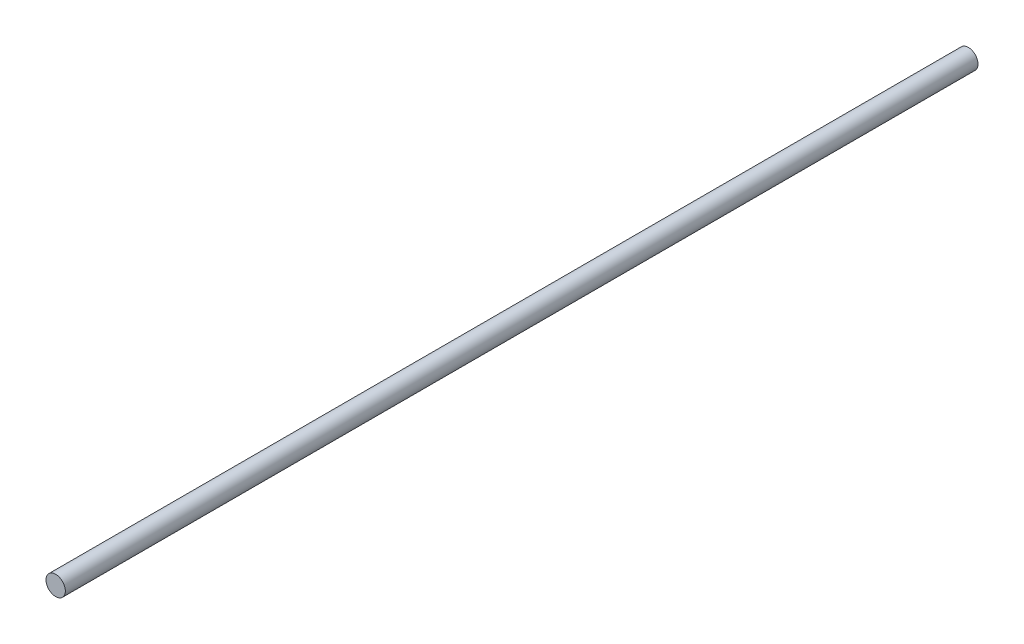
ISO-10303-21;
HEADER;
FILE_DESCRIPTION(('STEP AP214'),'2;1');
FILE_NAME('part.step','',(''),(''),'','','');
FILE_SCHEMA(('AUTOMOTIVE_DESIGN { 1 0 10303 214 1 1 1 1 }'));
ENDSEC;
DATA;
#1=APPLICATION_CONTEXT('core data for automotive mechanical design processes');
#2=APPLICATION_PROTOCOL_DEFINITION('international standard','automotive_design',2000,#1);
#3=PRODUCT_CONTEXT('',#1,'mechanical');
#4=PRODUCT('Part','Part','',(#3));
#5=PRODUCT_RELATED_PRODUCT_CATEGORY('part','',(#4));
#6=PRODUCT_DEFINITION_FORMATION('','',#4);
#7=PRODUCT_DEFINITION_CONTEXT('part definition',#1,'design');
#8=PRODUCT_DEFINITION('design','',#6,#7);
#9=PRODUCT_DEFINITION_SHAPE('','',#8);
#10=(LENGTH_UNIT() NAMED_UNIT(*) SI_UNIT(.MILLI.,.METRE.));
#11=(NAMED_UNIT(*) PLANE_ANGLE_UNIT() SI_UNIT($,.RADIAN.));
#12=(NAMED_UNIT(*) SI_UNIT($,.STERADIAN.) SOLID_ANGLE_UNIT());
#13=UNCERTAINTY_MEASURE_WITH_UNIT(LENGTH_MEASURE(1.E-05),#10,'distance_accuracy_value','');
#14=(GEOMETRIC_REPRESENTATION_CONTEXT(3) GLOBAL_UNCERTAINTY_ASSIGNED_CONTEXT((#13)) GLOBAL_UNIT_ASSIGNED_CONTEXT((#10,
#11,#12)) REPRESENTATION_CONTEXT('',''));
#15=CARTESIAN_POINT('',(0.,0.,0.));
#16=DIRECTION('',(0.,0.,1.));
#17=DIRECTION('',(1.,0.,0.));
#18=AXIS2_PLACEMENT_3D('',#15,#16,#17);
#19=CARTESIAN_POINT('',(0.,0.,377.));
#20=DIRECTION('',(0.,0.,-1.));
#21=DIRECTION('',(-1.,0.,0.));
#22=AXIS2_PLACEMENT_3D('',#19,#20,#21);
#23=CYLINDRICAL_SURFACE('',#22,4.);
#24=CARTESIAN_POINT('',(0.,0.,377.));
#25=DIRECTION('',(0.,0.,1.));
#26=DIRECTION('',(1.,0.,0.));
#27=AXIS2_PLACEMENT_3D('',#24,#25,#26);
#28=CIRCLE('',#27,4.);
#29=CARTESIAN_POINT('',(4.,0.,377.));
#30=VERTEX_POINT('',#29);
#31=EDGE_CURVE('E10',#30,#30,#28,.T.);
#32=ORIENTED_EDGE('',*,*,#31,.F.);
#33=EDGE_LOOP('',(#32));
#34=FACE_BOUND('',#33,.T.);
#35=CARTESIAN_POINT('',(0.,0.,0.));
#36=DIRECTION('',(0.,0.,1.));
#37=DIRECTION('',(1.,0.,0.));
#38=AXIS2_PLACEMENT_3D('',#35,#36,#37);
#39=CIRCLE('',#38,4.);
#40=CARTESIAN_POINT('',(4.,0.,0.));
#41=VERTEX_POINT('',#40);
#42=EDGE_CURVE('E36',#41,#41,#39,.T.);
#43=ORIENTED_EDGE('',*,*,#42,.T.);
#44=EDGE_LOOP('',(#43));
#45=FACE_BOUND('',#44,.T.);
#46=ADVANCED_FACE('F33',(#34,#45),#23,.T.);
#47=CARTESIAN_POINT('',(0.,0.,377.));
#48=DIRECTION('',(0.,0.,1.));
#49=DIRECTION('',(1.,0.,0.));
#50=AXIS2_PLACEMENT_3D('',#47,#48,#49);
#51=PLANE('',#50);
#52=ORIENTED_EDGE('',*,*,#31,.T.);
#53=EDGE_LOOP('',(#52));
#54=FACE_BOUND('',#53,.T.);
#55=ADVANCED_FACE('F48',(#54),#51,.T.);
#56=CARTESIAN_POINT('',(0.,0.,0.));
#57=DIRECTION('',(0.,0.,1.));
#58=DIRECTION('',(1.,0.,0.));
#59=AXIS2_PLACEMENT_3D('',#56,#57,#58);
#60=PLANE('',#59);
#61=ORIENTED_EDGE('',*,*,#42,.F.);
#62=EDGE_LOOP('',(#61));
#63=FACE_BOUND('',#62,.T.);
#64=ADVANCED_FACE('F46',(#63),#60,.F.);
#65=CLOSED_SHELL('',(#46,#55,#64));
#66=MANIFOLD_SOLID_BREP('B2',#65);
#67=ADVANCED_BREP_SHAPE_REPRESENTATION('',(#18,#66),#14);
#68=SHAPE_DEFINITION_REPRESENTATION(#9,#67);
ENDSEC;
END-ISO-10303-21;
